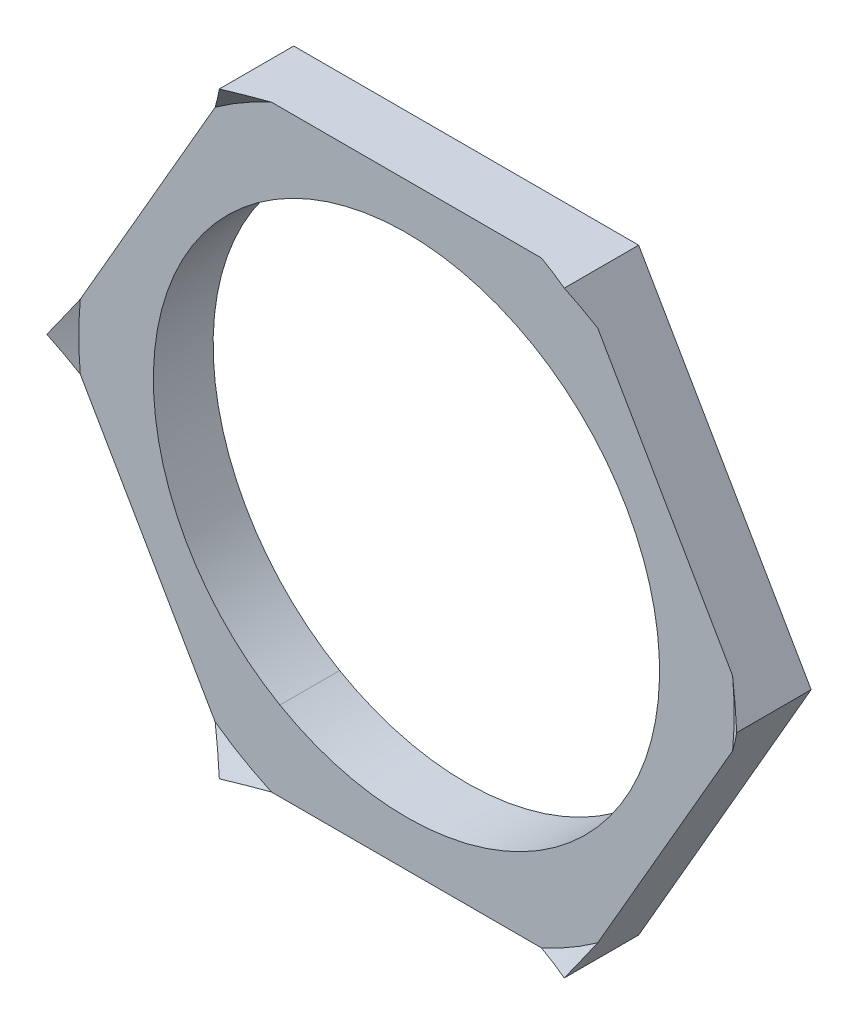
ISO-10303-21;
HEADER;
FILE_DESCRIPTION(('STEP AP214'),'2;1');
FILE_NAME('part.step','',(''),(''),'','','');
FILE_SCHEMA(('AUTOMOTIVE_DESIGN { 1 0 10303 214 1 1 1 1 }'));
ENDSEC;
DATA;
#1=APPLICATION_CONTEXT('core data for automotive mechanical design processes');
#2=APPLICATION_PROTOCOL_DEFINITION('international standard','automotive_design',2000,#1);
#3=PRODUCT_CONTEXT('',#1,'mechanical');
#4=PRODUCT('Part','Part','',(#3));
#5=PRODUCT_RELATED_PRODUCT_CATEGORY('part','',(#4));
#6=PRODUCT_DEFINITION_FORMATION('','',#4);
#7=PRODUCT_DEFINITION_CONTEXT('part definition',#1,'design');
#8=PRODUCT_DEFINITION('design','',#6,#7);
#9=PRODUCT_DEFINITION_SHAPE('','',#8);
#10=(LENGTH_UNIT() NAMED_UNIT(*) SI_UNIT(.MILLI.,.METRE.));
#11=(NAMED_UNIT(*) PLANE_ANGLE_UNIT() SI_UNIT($,.RADIAN.));
#12=(NAMED_UNIT(*) SI_UNIT($,.STERADIAN.) SOLID_ANGLE_UNIT());
#13=UNCERTAINTY_MEASURE_WITH_UNIT(LENGTH_MEASURE(1.E-05),#10,'distance_accuracy_value','');
#14=(GEOMETRIC_REPRESENTATION_CONTEXT(3) GLOBAL_UNCERTAINTY_ASSIGNED_CONTEXT((#13)) GLOBAL_UNIT_ASSIGNED_CONTEXT((#10,
#11,#12)) REPRESENTATION_CONTEXT('',''));
#15=CARTESIAN_POINT('',(0.,0.,0.));
#16=DIRECTION('',(0.,0.,1.));
#17=DIRECTION('',(1.,0.,0.));
#18=AXIS2_PLACEMENT_3D('',#15,#16,#17);
#19=CARTESIAN_POINT('',(0.,0.,-10.4));
#20=DIRECTION('',(0.,0.,1.));
#21=DIRECTION('',(-0.866025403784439,0.5,0.));
#22=AXIS2_PLACEMENT_3D('',#19,#20,#21);
#23=PLANE('',#22);
#24=CARTESIAN_POINT('',(0.,0.,-10.4));
#25=DIRECTION('',(0.,0.,1.));
#26=DIRECTION('',(0.5,0.866025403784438,0.));
#27=AXIS2_PLACEMENT_3D('',#24,#25,#26);
#28=CIRCLE('',#27,15.25);
#29=CARTESIAN_POINT('',(-7.625,-13.2068874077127,-10.4));
#30=VERTEX_POINT('',#29);
#31=CARTESIAN_POINT('',(7.625,13.2068874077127,-10.4));
#32=VERTEX_POINT('',#31);
#33=EDGE_CURVE('E507',#30,#32,#28,.T.);
#34=ORIENTED_EDGE('',*,*,#33,.F.);
#35=CARTESIAN_POINT('',(0.,0.,-10.4));
#36=DIRECTION('',(0.,0.,1.));
#37=DIRECTION('',(0.5,0.866025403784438,0.));
#38=AXIS2_PLACEMENT_3D('',#35,#36,#37);
#39=CIRCLE('',#38,15.25);
#40=EDGE_CURVE('E536',#32,#30,#39,.T.);
#41=ORIENTED_EDGE('',*,*,#40,.F.);
#42=EDGE_LOOP('',(#34,#41));
#43=FACE_BOUND('',#42,.T.);
#44=DIRECTION('',(-1.,0.,0.));
#45=VECTOR('',#44,1.);
#46=CARTESIAN_POINT('',(-10.3923048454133,18.,-10.4));
#47=LINE('',#46,#45);
#48=CARTESIAN_POINT('',(8.12788410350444,18.,-10.4));
#49=VERTEX_POINT('',#48);
#50=CARTESIAN_POINT('',(-8.12788410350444,18.,-10.4));
#51=VERTEX_POINT('',#50);
#52=EDGE_CURVE('E478',#49,#51,#47,.T.);
#53=ORIENTED_EDGE('',*,*,#52,.T.);
#54=CARTESIAN_POINT('',(0.,0.,-10.4));
#55=DIRECTION('',(0.,0.,1.));
#56=DIRECTION('',(0.5,0.866025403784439,0.));
#57=AXIS2_PLACEMENT_3D('',#54,#55,#56);
#58=CIRCLE('',#57,19.75);
#59=CARTESIAN_POINT('',(-11.5245152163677,16.0389541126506,-10.4));
#60=VERTEX_POINT('',#59);
#61=EDGE_CURVE('E377',#51,#60,#58,.T.);
#62=ORIENTED_EDGE('',*,*,#61,.T.);
#63=DIRECTION('',(-0.5,-0.866025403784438,0.));
#64=VECTOR('',#63,1.);
#65=CARTESIAN_POINT('',(-10.3923048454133,18.,-10.4));
#66=LINE('',#65,#64);
#67=CARTESIAN_POINT('',(-19.6523993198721,1.96104588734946,-10.4));
#68=VERTEX_POINT('',#67);
#69=EDGE_CURVE('E416',#60,#68,#66,.T.);
#70=ORIENTED_EDGE('',*,*,#69,.T.);
#71=CARTESIAN_POINT('',(0.,0.,-10.4));
#72=DIRECTION('',(0.,0.,1.));
#73=DIRECTION('',(0.5,0.866025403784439,0.));
#74=AXIS2_PLACEMENT_3D('',#71,#72,#73);
#75=CIRCLE('',#74,19.75);
#76=CARTESIAN_POINT('',(-19.6523993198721,-1.96104588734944,-10.4));
#77=VERTEX_POINT('',#76);
#78=EDGE_CURVE('E374',#68,#77,#75,.T.);
#79=ORIENTED_EDGE('',*,*,#78,.T.);
#80=DIRECTION('',(0.5,-0.866025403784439,0.));
#81=VECTOR('',#80,1.);
#82=CARTESIAN_POINT('',(-20.7846096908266,0.,-10.4));
#83=LINE('',#82,#81);
#84=CARTESIAN_POINT('',(-11.5245152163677,-16.0389541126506,-10.4));
#85=VERTEX_POINT('',#84);
#86=EDGE_CURVE('E344',#77,#85,#83,.T.);
#87=ORIENTED_EDGE('',*,*,#86,.T.);
#88=CARTESIAN_POINT('',(0.,0.,-10.4));
#89=DIRECTION('',(0.,0.,1.));
#90=DIRECTION('',(0.5,0.866025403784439,0.));
#91=AXIS2_PLACEMENT_3D('',#88,#89,#90);
#92=CIRCLE('',#91,19.75);
#93=CARTESIAN_POINT('',(-8.12788410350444,-18.,-10.4));
#94=VERTEX_POINT('',#93);
#95=EDGE_CURVE('E25',#85,#94,#92,.T.);
#96=ORIENTED_EDGE('',*,*,#95,.T.);
#97=DIRECTION('',(1.,0.,0.));
#98=VECTOR('',#97,1.);
#99=CARTESIAN_POINT('',(10.3923048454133,-18.,-10.4));
#100=LINE('',#99,#98);
#101=CARTESIAN_POINT('',(8.12788410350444,-18.,-10.4));
#102=VERTEX_POINT('',#101);
#103=EDGE_CURVE('E539',#94,#102,#100,.T.);
#104=ORIENTED_EDGE('',*,*,#103,.T.);
#105=CARTESIAN_POINT('',(0.,0.,-10.4));
#106=DIRECTION('',(0.,0.,1.));
#107=DIRECTION('',(0.5,0.866025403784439,0.));
#108=AXIS2_PLACEMENT_3D('',#105,#106,#107);
#109=CIRCLE('',#108,19.75);
#110=CARTESIAN_POINT('',(11.5245152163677,-16.0389541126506,-10.4));
#111=VERTEX_POINT('',#110);
#112=EDGE_CURVE('E11',#102,#111,#109,.T.);
#113=ORIENTED_EDGE('',*,*,#112,.T.);
#114=DIRECTION('',(0.5,0.866025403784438,0.));
#115=VECTOR('',#114,1.);
#116=CARTESIAN_POINT('',(20.7846096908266,0.,-10.4));
#117=LINE('',#116,#115);
#118=CARTESIAN_POINT('',(19.6523993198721,-1.96104588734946,-10.4));
#119=VERTEX_POINT('',#118);
#120=EDGE_CURVE('E582',#111,#119,#117,.T.);
#121=ORIENTED_EDGE('',*,*,#120,.T.);
#122=CARTESIAN_POINT('',(0.,0.,-10.4));
#123=DIRECTION('',(0.,0.,1.));
#124=DIRECTION('',(0.5,0.866025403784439,0.));
#125=AXIS2_PLACEMENT_3D('',#122,#123,#124);
#126=CIRCLE('',#125,19.75);
#127=CARTESIAN_POINT('',(19.6523993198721,1.96104588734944,-10.4));
#128=VERTEX_POINT('',#127);
#129=EDGE_CURVE('E252',#119,#128,#126,.T.);
#130=ORIENTED_EDGE('',*,*,#129,.T.);
#131=DIRECTION('',(-0.5,0.866025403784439,0.));
#132=VECTOR('',#131,1.);
#133=CARTESIAN_POINT('',(20.7846096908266,0.,-10.4));
#134=LINE('',#133,#132);
#135=CARTESIAN_POINT('',(11.5245152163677,16.0389541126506,-10.4));
#136=VERTEX_POINT('',#135);
#137=EDGE_CURVE('E591',#128,#136,#134,.T.);
#138=ORIENTED_EDGE('',*,*,#137,.T.);
#139=CARTESIAN_POINT('',(0.,0.,-10.4));
#140=DIRECTION('',(0.,0.,1.));
#141=DIRECTION('',(0.5,0.866025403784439,0.));
#142=AXIS2_PLACEMENT_3D('',#139,#140,#141);
#143=CIRCLE('',#142,19.75);
#144=CARTESIAN_POINT('',(9.875,17.1040017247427,-10.4));
#145=VERTEX_POINT('',#144);
#146=EDGE_CURVE('E297',#136,#145,#143,.T.);
#147=ORIENTED_EDGE('',*,*,#146,.T.);
#148=CARTESIAN_POINT('',(0.,0.,-10.4));
#149=DIRECTION('',(0.,0.,1.));
#150=DIRECTION('',(0.5,0.866025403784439,0.));
#151=AXIS2_PLACEMENT_3D('',#148,#149,#150);
#152=CIRCLE('',#151,19.75);
#153=EDGE_CURVE('E204',#145,#49,#152,.T.);
#154=ORIENTED_EDGE('',*,*,#153,.T.);
#155=EDGE_LOOP('',(#53,#62,#70,#79,#87,#96,#104,#113,#121,#130,#138,#147,#154));
#156=FACE_BOUND('',#155,.T.);
#157=ADVANCED_FACE('F16',(#43,#156),#23,.T.);
#158=CARTESIAN_POINT('',(0.,0.,-10.4));
#159=DIRECTION('',(0.,0.,1.));
#160=DIRECTION('',(0.5,0.866025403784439,0.));
#161=AXIS2_PLACEMENT_3D('',#158,#159,#160);
#162=CONICAL_SURFACE('',#161,19.75,0.863937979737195);
#163=CARTESIAN_POINT('',(10.3923048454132,-18.,-9.51635984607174));
#164=CARTESIAN_POINT('',(10.4400320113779,-17.9173340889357,-9.55712261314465));
#165=CARTESIAN_POINT('',(10.4878348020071,-17.834536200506,-9.5975297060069));
#166=CARTESIAN_POINT('',(10.5832433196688,-17.6692808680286,-9.67731426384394));
#167=CARTESIAN_POINT('',(10.6308479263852,-17.5868253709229,-9.71669710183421));
#168=CARTESIAN_POINT('',(10.7258693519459,-17.4222398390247,-9.79443330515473));
#169=CARTESIAN_POINT('',(10.7732850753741,-17.340111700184,-9.83279202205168));
#170=CARTESIAN_POINT('',(10.8679381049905,-17.1761653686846,-9.90847996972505));
#171=CARTESIAN_POINT('',(10.9151743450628,-17.0943490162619,-9.94581451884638));
#172=CARTESIAN_POINT('',(11.0094779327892,-16.9310101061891,-10.0194541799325));
#173=CARTESIAN_POINT('',(11.0565442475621,-16.8494893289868,-10.0557645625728));
#174=CARTESIAN_POINT('',(11.1505175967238,-16.6867247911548,-10.1273559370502));
#175=CARTESIAN_POINT('',(11.1974236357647,-16.6054827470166,-10.1626421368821));
#176=CARTESIAN_POINT('',(11.2910861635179,-16.4432582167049,-10.2321852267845));
#177=CARTESIAN_POINT('',(11.3378416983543,-16.3622773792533,-10.2664472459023));
#178=CARTESIAN_POINT('',(11.431212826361,-16.2005572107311,-10.3339420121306));
#179=CARTESIAN_POINT('',(11.4778275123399,-16.1198194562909,-10.3671797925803));
#180=CARTESIAN_POINT('',(11.5245152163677,-16.0389541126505,-10.4));
#181=B_SPLINE_CURVE_WITH_KNOTS('',3,(#163,#164,#165,#166,#167,#168,#169,#170,#171,#172,#173,
#174,#175,#176,#177,#178,#179,#180),.UNSPECIFIED.,.F.,.F.,(4,2,2,2,2,2,2,2,4),(0.,
0.311380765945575,0.62048133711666,0.927369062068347,1.23211385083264,1.53478821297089,
1.8354672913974,2.13422889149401,2.43115350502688),.UNSPECIFIED.);
#182=CARTESIAN_POINT('',(10.3923048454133,-18.,-9.51635984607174));
#183=VERTEX_POINT('',#182);
#184=EDGE_CURVE('E575',#183,#111,#181,.T.);
#185=ORIENTED_EDGE('',*,*,#184,.T.);
#186=ORIENTED_EDGE('',*,*,#112,.F.);
#187=CARTESIAN_POINT('',(8.12788410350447,-18.,-10.4));
#188=CARTESIAN_POINT('',(8.22125939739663,-17.9999999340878,-10.3671797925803));
#189=CARTESIAN_POINT('',(8.31448768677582,-17.9999993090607,-10.3339420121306));
#190=CARTESIAN_POINT('',(8.50122702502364,-17.9999976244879,-10.2664472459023));
#191=CARTESIAN_POINT('',(8.5947362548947,-17.9999965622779,-10.2321852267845));
#192=CARTESIAN_POINT('',(8.78205808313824,-17.9999946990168,-10.1626421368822));
#193=CARTESIAN_POINT('',(8.87586877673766,-17.9999938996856,-10.1273559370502));
#194=CARTESIAN_POINT('',(9.06381367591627,-17.9999928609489,-10.0557645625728));
#195=CARTESIAN_POINT('',(9.15794589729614,-17.9999926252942,-10.0194541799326));
#196=CARTESIAN_POINT('',(9.34655333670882,-17.9999927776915,-9.94581451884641));
#197=CARTESIAN_POINT('',(9.44102649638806,-17.999993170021,-9.90847996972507));
#198=CARTESIAN_POINT('',(9.630334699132,-17.9999944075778,-9.8327920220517));
#199=CARTESIAN_POINT('',(9.72516761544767,-17.9999952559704,-9.79443330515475));
#200=CARTESIAN_POINT('',(9.91521357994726,-17.9999970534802,-9.71669710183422));
#201=CARTESIAN_POINT('',(10.0104244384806,-17.9999980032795,-9.67731426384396));
#202=CARTESIAN_POINT('',(10.2012440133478,-17.9999994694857,-9.59752970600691));
#203=CARTESIAN_POINT('',(10.2968504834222,-17.9999999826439,-9.55712261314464));
#204=CARTESIAN_POINT('',(10.3923048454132,-18.,-9.51635984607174));
#205=B_SPLINE_CURVE_WITH_KNOTS('',3,(#187,#188,#189,#190,#191,#192,#193,#194,#195,#196,#197,
#198,#199,#200,#201,#202,#203,#204),.UNSPECIFIED.,.F.,.F.,(4,2,2,2,2,2,2,2,4),(0.,
0.296924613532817,0.59568621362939,0.896365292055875,1.1990396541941,1.50378444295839,
1.8106721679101,2.11977273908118,2.43115350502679),.UNSPECIFIED.);
#206=EDGE_CURVE('E548',#102,#183,#205,.T.);
#207=ORIENTED_EDGE('',*,*,#206,.T.);
#208=EDGE_LOOP('',(#185,#186,#207));
#209=FACE_BOUND('',#208,.T.);
#210=ADVANCED_FACE('F557',(#209),#162,.F.);
#211=CARTESIAN_POINT('',(0.,0.,-10.4));
#212=DIRECTION('',(0.,0.,1.));
#213=DIRECTION('',(0.5,0.866025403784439,0.));
#214=AXIS2_PLACEMENT_3D('',#211,#212,#213);
#215=CONICAL_SURFACE('',#214,19.75,0.863937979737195);
#216=CARTESIAN_POINT('',(-11.5245152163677,-16.0389541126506,-10.4));
#217=CARTESIAN_POINT('',(-11.4778275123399,-16.1198194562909,-10.3671797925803));
#218=CARTESIAN_POINT('',(-11.431212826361,-16.2005572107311,-10.3339420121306));
#219=CARTESIAN_POINT('',(-11.3378416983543,-16.3622773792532,-10.2664472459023));
#220=CARTESIAN_POINT('',(-11.2910861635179,-16.4432582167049,-10.2321852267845));
#221=CARTESIAN_POINT('',(-11.1974236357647,-16.6054827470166,-10.1626421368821));
#222=CARTESIAN_POINT('',(-11.1505175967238,-16.6867247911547,-10.1273559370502));
#223=CARTESIAN_POINT('',(-11.0565442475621,-16.8494893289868,-10.0557645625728));
#224=CARTESIAN_POINT('',(-11.0094779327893,-16.9310101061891,-10.0194541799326));
#225=CARTESIAN_POINT('',(-10.9151743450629,-17.0943490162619,-9.94581451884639));
#226=CARTESIAN_POINT('',(-10.8679381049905,-17.1761653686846,-9.90847996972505));
#227=CARTESIAN_POINT('',(-10.7732850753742,-17.340111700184,-9.83279202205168));
#228=CARTESIAN_POINT('',(-10.7258693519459,-17.4222398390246,-9.79443330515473));
#229=CARTESIAN_POINT('',(-10.6308479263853,-17.5868253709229,-9.71669710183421));
#230=CARTESIAN_POINT('',(-10.5832433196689,-17.6692808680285,-9.67731426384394));
#231=CARTESIAN_POINT('',(-10.4878348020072,-17.834536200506,-9.59752970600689));
#232=CARTESIAN_POINT('',(-10.440032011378,-17.9173340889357,-9.55712261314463));
#233=CARTESIAN_POINT('',(-10.3923048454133,-18.,-9.51635984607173));
#234=B_SPLINE_CURVE_WITH_KNOTS('',3,(#216,#217,#218,#219,#220,#221,#222,#223,#224,#225,#226,
#227,#228,#229,#230,#231,#232,#233),.UNSPECIFIED.,.F.,.F.,(4,2,2,2,2,2,2,2,4),(0.,
0.296924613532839,0.595686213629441,0.89636529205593,1.19903965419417,1.50378444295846,
1.81067216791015,2.11977273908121,2.4311535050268),.UNSPECIFIED.);
#235=CARTESIAN_POINT('',(-10.3923048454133,-18.,-9.51635984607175));
#236=VERTEX_POINT('',#235);
#237=EDGE_CURVE('E328',#85,#236,#234,.T.);
#238=ORIENTED_EDGE('',*,*,#237,.T.);
#239=CARTESIAN_POINT('',(-10.3923048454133,-18.,-9.51635984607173));
#240=CARTESIAN_POINT('',(-10.2968504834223,-17.9999999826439,-9.55712261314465));
#241=CARTESIAN_POINT('',(-10.2012440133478,-17.9999994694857,-9.59752970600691));
#242=CARTESIAN_POINT('',(-10.0104244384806,-17.9999980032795,-9.67731426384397));
#243=CARTESIAN_POINT('',(-9.91521357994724,-17.9999970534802,-9.71669710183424));
#244=CARTESIAN_POINT('',(-9.72516761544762,-17.9999952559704,-9.79443330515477));
#245=CARTESIAN_POINT('',(-9.63033469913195,-17.9999944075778,-9.83279202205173));
#246=CARTESIAN_POINT('',(-9.44102649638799,-17.999993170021,-9.9084799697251));
#247=CARTESIAN_POINT('',(-9.34655333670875,-17.9999927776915,-9.94581451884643));
#248=CARTESIAN_POINT('',(-9.15794589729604,-17.9999926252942,-10.0194541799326));
#249=CARTESIAN_POINT('',(-9.06381367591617,-17.9999928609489,-10.0557645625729));
#250=CARTESIAN_POINT('',(-8.87586877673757,-17.9999938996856,-10.1273559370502));
#251=CARTESIAN_POINT('',(-8.78205808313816,-17.9999946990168,-10.1626421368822));
#252=CARTESIAN_POINT('',(-8.59473625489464,-17.9999965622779,-10.2321852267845));
#253=CARTESIAN_POINT('',(-8.50122702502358,-17.9999976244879,-10.2664472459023));
#254=CARTESIAN_POINT('',(-8.31448768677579,-17.9999993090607,-10.3339420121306));
#255=CARTESIAN_POINT('',(-8.22125939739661,-17.9999999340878,-10.3671797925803));
#256=CARTESIAN_POINT('',(-8.12788410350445,-18.,-10.4));
#257=B_SPLINE_CURVE_WITH_KNOTS('',3,(#239,#240,#241,#242,#243,#244,#245,#246,#247,#248,#249,
#250,#251,#252,#253,#254,#255,#256),.UNSPECIFIED.,.F.,.F.,(4,2,2,2,2,2,2,2,4),(0.,
0.311380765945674,0.620481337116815,0.927369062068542,1.23211385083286,1.53478821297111,
1.83546729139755,2.13422889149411,2.43115350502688),.UNSPECIFIED.);
#258=EDGE_CURVE('E549',#236,#94,#257,.T.);
#259=ORIENTED_EDGE('',*,*,#258,.T.);
#260=ORIENTED_EDGE('',*,*,#95,.F.);
#261=EDGE_LOOP('',(#238,#259,#260));
#262=FACE_BOUND('',#261,.T.);
#263=ADVANCED_FACE('F227',(#262),#215,.F.);
#264=CARTESIAN_POINT('',(0.,0.,-10.4));
#265=DIRECTION('',(0.,0.,1.));
#266=DIRECTION('',(0.5,0.866025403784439,0.));
#267=AXIS2_PLACEMENT_3D('',#264,#265,#266);
#268=CONICAL_SURFACE('',#267,19.75,0.863937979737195);
#269=CARTESIAN_POINT('',(20.7846096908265,0.,-9.51635984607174));
#270=CARTESIAN_POINT('',(20.7368824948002,0.0826658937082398,-9.55712261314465));
#271=CARTESIAN_POINT('',(20.689078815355,0.165463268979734,-9.59752970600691));
#272=CARTESIAN_POINT('',(20.5936677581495,0.330717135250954,-9.67731426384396));
#273=CARTESIAN_POINT('',(20.5460615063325,0.413171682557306,-9.71669710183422));
#274=CARTESIAN_POINT('',(20.4510369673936,0.577755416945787,-9.79443330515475));
#275=CARTESIAN_POINT('',(20.4036197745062,0.659882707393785,-9.83279202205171));
#276=CARTESIAN_POINT('',(20.3089646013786,0.823827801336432,-9.90847996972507));
#277=CARTESIAN_POINT('',(20.2617276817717,0.905643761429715,-9.94581451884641));
#278=CARTESIAN_POINT('',(20.1674238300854,1.06898251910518,-10.0194541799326));
#279=CARTESIAN_POINT('',(20.1203579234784,1.15050353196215,-10.0557645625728));
#280=CARTESIAN_POINT('',(20.0263863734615,1.31326910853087,-10.1273559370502));
#281=CARTESIAN_POINT('',(19.9794817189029,1.39451195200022,-10.1626421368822));
#282=CARTESIAN_POINT('',(19.8858224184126,1.55673834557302,-10.2321852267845));
#283=CARTESIAN_POINT('',(19.8390687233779,1.6377202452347,-10.2664472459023));
#284=CARTESIAN_POINT('',(19.7457005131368,1.79944209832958,-10.3339420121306));
#285=CARTESIAN_POINT('',(19.6990869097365,1.88018047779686,-10.3671797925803));
#286=CARTESIAN_POINT('',(19.6523993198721,1.96104588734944,-10.4));
#287=B_SPLINE_CURVE_WITH_KNOTS('',3,(#269,#270,#271,#272,#273,#274,#275,#276,#277,#278,#279,
#280,#281,#282,#283,#284,#285,#286),.UNSPECIFIED.,.F.,.F.,(4,2,2,2,2,2,2,2,4),(0.,
0.311380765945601,0.620481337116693,0.927369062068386,1.2321138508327,1.53478821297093,
1.8354672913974,2.13422889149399,2.43115350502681),.UNSPECIFIED.);
#288=CARTESIAN_POINT('',(20.7846096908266,0.,-9.51635984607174));
#289=VERTEX_POINT('',#288);
#290=EDGE_CURVE('E210',#289,#128,#287,.T.);
#291=ORIENTED_EDGE('',*,*,#290,.T.);
#292=ORIENTED_EDGE('',*,*,#129,.F.);
#293=CARTESIAN_POINT('',(19.6523993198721,-1.96104588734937,-10.4));
#294=CARTESIAN_POINT('',(19.6990869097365,-1.88018047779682,-10.3671797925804));
#295=CARTESIAN_POINT('',(19.7457005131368,-1.79944209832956,-10.3339420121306));
#296=CARTESIAN_POINT('',(19.8390687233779,-1.63772024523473,-10.2664472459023));
#297=CARTESIAN_POINT('',(19.8858224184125,-1.55673834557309,-10.2321852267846));
#298=CARTESIAN_POINT('',(19.9794817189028,-1.39451195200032,-10.1626421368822));
#299=CARTESIAN_POINT('',(20.0263863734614,-1.31326910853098,-10.1273559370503));
#300=CARTESIAN_POINT('',(20.1203579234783,-1.15050353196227,-10.0557645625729));
#301=CARTESIAN_POINT('',(20.1674238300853,-1.06898251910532,-10.0194541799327));
#302=CARTESIAN_POINT('',(20.2617276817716,-0.905643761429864,-9.94581451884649));
#303=CARTESIAN_POINT('',(20.3089646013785,-0.823827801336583,-9.90847996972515));
#304=CARTESIAN_POINT('',(20.4036197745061,-0.659882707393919,-9.83279202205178));
#305=CARTESIAN_POINT('',(20.4510369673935,-0.577755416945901,-9.79443330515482));
#306=CARTESIAN_POINT('',(20.5460615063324,-0.413171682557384,-9.71669710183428));
#307=CARTESIAN_POINT('',(20.5936677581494,-0.330717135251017,-9.677314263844));
#308=CARTESIAN_POINT('',(20.6890788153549,-0.165463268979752,-9.59752970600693));
#309=CARTESIAN_POINT('',(20.7368824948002,-0.0826658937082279,-9.55712261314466));
#310=CARTESIAN_POINT('',(20.7846096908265,0.,-9.51635984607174));
#311=B_SPLINE_CURVE_WITH_KNOTS('',3,(#293,#294,#295,#296,#297,#298,#299,#300,#301,#302,#303,
#304,#305,#306,#307,#308,#309,#310),.UNSPECIFIED.,.F.,.F.,(4,2,2,2,2,2,2,2,4),(0.,
0.296924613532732,0.595686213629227,0.896365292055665,1.19903965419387,1.50378444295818,
1.81067216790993,2.11977273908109,2.4311535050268),.UNSPECIFIED.);
#312=EDGE_CURVE('E247',#119,#289,#311,.T.);
#313=ORIENTED_EDGE('',*,*,#312,.T.);
#314=EDGE_LOOP('',(#291,#292,#313));
#315=FACE_BOUND('',#314,.T.);
#316=ADVANCED_FACE('F216',(#315),#268,.F.);
#317=CARTESIAN_POINT('',(0.,0.,-10.4));
#318=DIRECTION('',(0.,0.,1.));
#319=DIRECTION('',(0.5,0.866025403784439,0.));
#320=AXIS2_PLACEMENT_3D('',#317,#318,#319);
#321=CONICAL_SURFACE('',#320,19.75,0.863937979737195);
#322=DIRECTION('',(0.380202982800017,0.658530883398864,0.649448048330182));
#323=VECTOR('',#322,1.);
#324=CARTESIAN_POINT('',(9.875,17.1040017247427,-10.4));
#325=LINE('',#324,#323);
#326=CARTESIAN_POINT('',(10.3923048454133,18.,-9.51635984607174));
#327=VERTEX_POINT('',#326);
#328=EDGE_CURVE('E201',#145,#327,#325,.T.);
#329=ORIENTED_EDGE('',*,*,#328,.F.);
#330=ORIENTED_EDGE('',*,*,#146,.F.);
#331=CARTESIAN_POINT('',(11.5245152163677,16.0389541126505,-10.4));
#332=CARTESIAN_POINT('',(11.47782751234,16.1198194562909,-10.3671797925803));
#333=CARTESIAN_POINT('',(11.431212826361,16.2005572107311,-10.3339420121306));
#334=CARTESIAN_POINT('',(11.3378416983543,16.3622773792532,-10.2664472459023));
#335=CARTESIAN_POINT('',(11.2910861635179,16.4432582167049,-10.2321852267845));
#336=CARTESIAN_POINT('',(11.1974236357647,16.6054827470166,-10.1626421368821));
#337=CARTESIAN_POINT('',(11.1505175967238,16.6867247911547,-10.1273559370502));
#338=CARTESIAN_POINT('',(11.0565442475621,16.8494893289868,-10.0557645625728));
#339=CARTESIAN_POINT('',(11.0094779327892,16.9310101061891,-10.0194541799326));
#340=CARTESIAN_POINT('',(10.9151743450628,17.0943490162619,-9.9458145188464));
#341=CARTESIAN_POINT('',(10.8679381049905,17.1761653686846,-9.90847996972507));
#342=CARTESIAN_POINT('',(10.7732850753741,17.340111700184,-9.8327920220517));
#343=CARTESIAN_POINT('',(10.7258693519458,17.4222398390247,-9.79443330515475));
#344=CARTESIAN_POINT('',(10.6308479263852,17.5868253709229,-9.71669710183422));
#345=CARTESIAN_POINT('',(10.5832433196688,17.6692808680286,-9.67731426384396));
#346=CARTESIAN_POINT('',(10.4878348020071,17.8345362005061,-9.59752970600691));
#347=CARTESIAN_POINT('',(10.4400320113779,17.9173340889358,-9.55712261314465));
#348=CARTESIAN_POINT('',(10.3923048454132,18.,-9.51635984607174));
#349=B_SPLINE_CURVE_WITH_KNOTS('',3,(#331,#332,#333,#334,#335,#336,#337,#338,#339,#340,#341,
#342,#343,#344,#345,#346,#347,#348),.UNSPECIFIED.,.F.,.F.,(4,2,2,2,2,2,2,2,4),(0.,
0.296924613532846,0.595686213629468,0.896365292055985,1.19903965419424,1.50378444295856,
1.81067216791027,2.11977273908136,2.43115350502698),.UNSPECIFIED.);
#350=EDGE_CURVE('E167',#136,#327,#349,.T.);
#351=ORIENTED_EDGE('',*,*,#350,.T.);
#352=EDGE_LOOP('',(#329,#330,#351));
#353=FACE_BOUND('',#352,.T.);
#354=ADVANCED_FACE('F226',(#353),#321,.F.);
#355=CARTESIAN_POINT('',(0.,0.,-10.4));
#356=DIRECTION('',(0.,0.,1.));
#357=DIRECTION('',(0.5,0.866025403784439,0.));
#358=AXIS2_PLACEMENT_3D('',#355,#356,#357);
#359=CONICAL_SURFACE('',#358,19.75,0.863937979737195);
#360=CARTESIAN_POINT('',(-19.6523993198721,1.9610458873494,-10.4));
#361=CARTESIAN_POINT('',(-19.6990869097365,1.88018047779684,-10.3671797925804));
#362=CARTESIAN_POINT('',(-19.7457005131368,1.79944209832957,-10.3339420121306));
#363=CARTESIAN_POINT('',(-19.8390687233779,1.63772024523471,-10.2664472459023));
#364=CARTESIAN_POINT('',(-19.8858224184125,1.55673834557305,-10.2321852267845));
#365=CARTESIAN_POINT('',(-19.9794817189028,1.39451195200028,-10.1626421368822));
#366=CARTESIAN_POINT('',(-20.0263863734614,1.31326910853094,-10.1273559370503));
#367=CARTESIAN_POINT('',(-20.1203579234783,1.15050353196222,-10.0557645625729));
#368=CARTESIAN_POINT('',(-20.1674238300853,1.06898251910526,-10.0194541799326));
#369=CARTESIAN_POINT('',(-20.2617276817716,0.905643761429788,-9.94581451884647));
#370=CARTESIAN_POINT('',(-20.3089646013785,0.823827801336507,-9.90847996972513));
#371=CARTESIAN_POINT('',(-20.4036197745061,0.659882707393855,-9.83279202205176));
#372=CARTESIAN_POINT('',(-20.4510369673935,0.57775541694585,-9.7944333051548));
#373=CARTESIAN_POINT('',(-20.5460615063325,0.413171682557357,-9.71669710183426));
#374=CARTESIAN_POINT('',(-20.5936677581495,0.330717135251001,-9.67731426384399));
#375=CARTESIAN_POINT('',(-20.689078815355,0.165463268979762,-9.59752970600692));
#376=CARTESIAN_POINT('',(-20.7368824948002,0.0826658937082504,-9.55712261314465));
#377=CARTESIAN_POINT('',(-20.7846096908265,0.,-9.51635984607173));
#378=B_SPLINE_CURVE_WITH_KNOTS('',3,(#360,#361,#362,#363,#364,#365,#366,#367,#368,#369,#370,
#371,#372,#373,#374,#375,#376,#377),.UNSPECIFIED.,.F.,.F.,(4,2,2,2,2,2,2,2,4),(0.,
0.296924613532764,0.5956862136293,0.896365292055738,1.19903965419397,1.50378444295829,
1.81067216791,2.11977273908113,2.4311535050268),.UNSPECIFIED.);
#379=CARTESIAN_POINT('',(-20.7846096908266,0.,-9.51635984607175));
#380=VERTEX_POINT('',#379);
#381=EDGE_CURVE('E371',#68,#380,#378,.T.);
#382=ORIENTED_EDGE('',*,*,#381,.T.);
#383=CARTESIAN_POINT('',(-20.7846096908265,0.,-9.51635984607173));
#384=CARTESIAN_POINT('',(-20.7368824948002,-0.0826658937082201,-9.55712261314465));
#385=CARTESIAN_POINT('',(-20.689078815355,-0.165463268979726,-9.59752970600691));
#386=CARTESIAN_POINT('',(-20.5936677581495,-0.330717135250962,-9.67731426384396));
#387=CARTESIAN_POINT('',(-20.5460615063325,-0.41317168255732,-9.71669710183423));
#388=CARTESIAN_POINT('',(-20.4510369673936,-0.577755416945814,-9.79443330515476));
#389=CARTESIAN_POINT('',(-20.4036197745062,-0.659882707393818,-9.83279202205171));
#390=CARTESIAN_POINT('',(-20.3089646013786,-0.82382780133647,-9.90847996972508));
#391=CARTESIAN_POINT('',(-20.2617276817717,-0.905643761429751,-9.94581451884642));
#392=CARTESIAN_POINT('',(-20.1674238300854,-1.06898251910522,-10.0194541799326));
#393=CARTESIAN_POINT('',(-20.1203579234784,-1.15050353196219,-10.0557645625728));
#394=CARTESIAN_POINT('',(-20.0263863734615,-1.31326910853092,-10.1273559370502));
#395=CARTESIAN_POINT('',(-19.9794817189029,-1.39451195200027,-10.1626421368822));
#396=CARTESIAN_POINT('',(-19.8858224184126,-1.55673834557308,-10.2321852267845));
#397=CARTESIAN_POINT('',(-19.8390687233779,-1.63772024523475,-10.2664472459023));
#398=CARTESIAN_POINT('',(-19.7457005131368,-1.79944209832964,-10.3339420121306));
#399=CARTESIAN_POINT('',(-19.6990869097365,-1.88018047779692,-10.3671797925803));
#400=CARTESIAN_POINT('',(-19.6523993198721,-1.96104588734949,-10.4));
#401=B_SPLINE_CURVE_WITH_KNOTS('',3,(#383,#384,#385,#386,#387,#388,#389,#390,#391,#392,#393,
#394,#395,#396,#397,#398,#399,#400),.UNSPECIFIED.,.F.,.F.,(4,2,2,2,2,2,2,2,4),(0.,
0.311380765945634,0.620481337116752,0.927369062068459,1.23211385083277,1.53478821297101,
1.83546729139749,2.13422889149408,2.43115350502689),.UNSPECIFIED.);
#402=EDGE_CURVE('E411',#380,#77,#401,.T.);
#403=ORIENTED_EDGE('',*,*,#402,.T.);
#404=ORIENTED_EDGE('',*,*,#78,.F.);
#405=EDGE_LOOP('',(#382,#403,#404));
#406=FACE_BOUND('',#405,.T.);
#407=ADVANCED_FACE('F391',(#406),#359,.F.);
#408=CARTESIAN_POINT('',(0.,0.,-10.4));
#409=DIRECTION('',(0.,0.,1.));
#410=DIRECTION('',(0.5,0.866025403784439,0.));
#411=AXIS2_PLACEMENT_3D('',#408,#409,#410);
#412=CONICAL_SURFACE('',#411,19.75,0.863937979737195);
#413=CARTESIAN_POINT('',(-8.12788410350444,18.,-10.4));
#414=CARTESIAN_POINT('',(-8.22125939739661,17.9999999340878,-10.3671797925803));
#415=CARTESIAN_POINT('',(-8.3144876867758,17.9999993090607,-10.3339420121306));
#416=CARTESIAN_POINT('',(-8.50122702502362,17.9999976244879,-10.2664472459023));
#417=CARTESIAN_POINT('',(-8.59473625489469,17.9999965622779,-10.2321852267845));
#418=CARTESIAN_POINT('',(-8.78205808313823,17.9999946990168,-10.1626421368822));
#419=CARTESIAN_POINT('',(-8.87586877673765,17.9999938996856,-10.1273559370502));
#420=CARTESIAN_POINT('',(-9.06381367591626,17.9999928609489,-10.0557645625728));
#421=CARTESIAN_POINT('',(-9.15794589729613,17.9999926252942,-10.0194541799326));
#422=CARTESIAN_POINT('',(-9.34655333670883,17.9999927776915,-9.94581451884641));
#423=CARTESIAN_POINT('',(-9.44102649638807,17.999993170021,-9.90847996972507));
#424=CARTESIAN_POINT('',(-9.63033469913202,17.9999944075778,-9.83279202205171));
#425=CARTESIAN_POINT('',(-9.72516761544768,17.9999952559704,-9.79443330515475));
#426=CARTESIAN_POINT('',(-9.91521357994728,17.9999970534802,-9.71669710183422));
#427=CARTESIAN_POINT('',(-10.0104244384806,17.9999980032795,-9.67731426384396));
#428=CARTESIAN_POINT('',(-10.2012440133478,17.9999994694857,-9.59752970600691));
#429=CARTESIAN_POINT('',(-10.2968504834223,17.9999999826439,-9.55712261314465));
#430=CARTESIAN_POINT('',(-10.3923048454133,18.,-9.51635984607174));
#431=B_SPLINE_CURVE_WITH_KNOTS('',3,(#413,#414,#415,#416,#417,#418,#419,#420,#421,#422,#423,
#424,#425,#426,#427,#428,#429,#430),.UNSPECIFIED.,.F.,.F.,(4,2,2,2,2,2,2,2,4),(0.,
0.296924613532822,0.595686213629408,0.896365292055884,1.19903965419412,1.50378444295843,
1.81067216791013,2.11977273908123,2.43115350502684),.UNSPECIFIED.);
#432=CARTESIAN_POINT('',(-10.3923048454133,18.,-9.51635984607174));
#433=VERTEX_POINT('',#432);
#434=EDGE_CURVE('E456',#51,#433,#431,.T.);
#435=ORIENTED_EDGE('',*,*,#434,.T.);
#436=CARTESIAN_POINT('',(-10.3923048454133,18.,-9.51635984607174));
#437=CARTESIAN_POINT('',(-10.440032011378,17.9173340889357,-9.55712261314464));
#438=CARTESIAN_POINT('',(-10.4878348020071,17.834536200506,-9.5975297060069));
#439=CARTESIAN_POINT('',(-10.5832433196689,17.6692808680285,-9.67731426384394));
#440=CARTESIAN_POINT('',(-10.6308479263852,17.5868253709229,-9.71669710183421));
#441=CARTESIAN_POINT('',(-10.7258693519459,17.4222398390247,-9.79443330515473));
#442=CARTESIAN_POINT('',(-10.7732850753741,17.340111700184,-9.83279202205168));
#443=CARTESIAN_POINT('',(-10.8679381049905,17.1761653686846,-9.90847996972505));
#444=CARTESIAN_POINT('',(-10.9151743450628,17.0943490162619,-9.94581451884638));
#445=CARTESIAN_POINT('',(-11.0094779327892,16.9310101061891,-10.0194541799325));
#446=CARTESIAN_POINT('',(-11.0565442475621,16.8494893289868,-10.0557645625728));
#447=CARTESIAN_POINT('',(-11.1505175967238,16.6867247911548,-10.1273559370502));
#448=CARTESIAN_POINT('',(-11.1974236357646,16.6054827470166,-10.1626421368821));
#449=CARTESIAN_POINT('',(-11.2910861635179,16.4432582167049,-10.2321852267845));
#450=CARTESIAN_POINT('',(-11.3378416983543,16.3622773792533,-10.2664472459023));
#451=CARTESIAN_POINT('',(-11.431212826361,16.2005572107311,-10.3339420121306));
#452=CARTESIAN_POINT('',(-11.4778275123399,16.1198194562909,-10.3671797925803));
#453=CARTESIAN_POINT('',(-11.5245152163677,16.0389541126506,-10.4));
#454=B_SPLINE_CURVE_WITH_KNOTS('',3,(#436,#437,#438,#439,#440,#441,#442,#443,#444,#445,#446,
#447,#448,#449,#450,#451,#452,#453),.UNSPECIFIED.,.F.,.F.,(4,2,2,2,2,2,2,2,4),(0.,
0.311380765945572,0.620481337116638,0.927369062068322,1.23211385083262,1.53478821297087,
1.83546729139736,2.13422889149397,2.43115350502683),.UNSPECIFIED.);
#455=EDGE_CURVE('E435',#433,#60,#454,.T.);
#456=ORIENTED_EDGE('',*,*,#455,.T.);
#457=ORIENTED_EDGE('',*,*,#61,.F.);
#458=EDGE_LOOP('',(#435,#456,#457));
#459=FACE_BOUND('',#458,.T.);
#460=ADVANCED_FACE('F264',(#459),#412,.F.);
#461=CARTESIAN_POINT('',(0.,0.,-14.));
#462=DIRECTION('',(0.,0.,-1.));
#463=DIRECTION('',(-0.5,-0.866025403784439,0.));
#464=AXIS2_PLACEMENT_3D('',#461,#462,#463);
#465=PLANE('',#464);
#466=CARTESIAN_POINT('',(0.,0.,-14.));
#467=DIRECTION('',(0.,0.,1.));
#468=DIRECTION('',(0.5,0.866025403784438,0.));
#469=AXIS2_PLACEMENT_3D('',#466,#467,#468);
#470=CIRCLE('',#469,15.25);
#471=CARTESIAN_POINT('',(-7.625,-13.2068874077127,-14.));
#472=VERTEX_POINT('',#471);
#473=CARTESIAN_POINT('',(7.625,13.2068874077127,-14.));
#474=VERTEX_POINT('',#473);
#475=EDGE_CURVE('E193',#472,#474,#470,.T.);
#476=ORIENTED_EDGE('',*,*,#475,.T.);
#477=CARTESIAN_POINT('',(0.,0.,-14.));
#478=DIRECTION('',(0.,0.,1.));
#479=DIRECTION('',(0.5,0.866025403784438,0.));
#480=AXIS2_PLACEMENT_3D('',#477,#478,#479);
#481=CIRCLE('',#480,15.25);
#482=EDGE_CURVE('E461',#474,#472,#481,.T.);
#483=ORIENTED_EDGE('',*,*,#482,.T.);
#484=EDGE_LOOP('',(#476,#483));
#485=FACE_BOUND('',#484,.T.);
#486=DIRECTION('',(-1.,0.,0.));
#487=VECTOR('',#486,1.);
#488=CARTESIAN_POINT('',(-10.3923048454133,18.,-14.));
#489=LINE('',#488,#487);
#490=CARTESIAN_POINT('',(10.3923048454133,18.,-14.));
#491=VERTEX_POINT('',#490);
#492=CARTESIAN_POINT('',(-10.3923048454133,18.,-14.));
#493=VERTEX_POINT('',#492);
#494=EDGE_CURVE('E170',#491,#493,#489,.T.);
#495=ORIENTED_EDGE('',*,*,#494,.F.);
#496=DIRECTION('',(0.5,-0.866025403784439,0.));
#497=VECTOR('',#496,1.);
#498=CARTESIAN_POINT('',(20.7846096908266,0.,-14.));
#499=LINE('',#498,#497);
#500=CARTESIAN_POINT('',(20.7846096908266,0.,-14.));
#501=VERTEX_POINT('',#500);
#502=EDGE_CURVE('E154',#491,#501,#499,.T.);
#503=ORIENTED_EDGE('',*,*,#502,.T.);
#504=DIRECTION('',(-0.5,-0.866025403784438,0.));
#505=VECTOR('',#504,1.);
#506=CARTESIAN_POINT('',(20.7846096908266,0.,-14.));
#507=LINE('',#506,#505);
#508=CARTESIAN_POINT('',(10.3923048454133,-18.,-14.));
#509=VERTEX_POINT('',#508);
#510=EDGE_CURVE('E541',#501,#509,#507,.T.);
#511=ORIENTED_EDGE('',*,*,#510,.T.);
#512=DIRECTION('',(1.,0.,0.));
#513=VECTOR('',#512,1.);
#514=CARTESIAN_POINT('',(10.3923048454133,-18.,-14.));
#515=LINE('',#514,#513);
#516=CARTESIAN_POINT('',(-10.3923048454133,-18.,-14.));
#517=VERTEX_POINT('',#516);
#518=EDGE_CURVE('E545',#517,#509,#515,.T.);
#519=ORIENTED_EDGE('',*,*,#518,.F.);
#520=DIRECTION('',(-0.5,0.866025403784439,0.));
#521=VECTOR('',#520,1.);
#522=CARTESIAN_POINT('',(-20.7846096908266,0.,-14.));
#523=LINE('',#522,#521);
#524=CARTESIAN_POINT('',(-20.7846096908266,0.,-14.));
#525=VERTEX_POINT('',#524);
#526=EDGE_CURVE('E415',#517,#525,#523,.T.);
#527=ORIENTED_EDGE('',*,*,#526,.T.);
#528=DIRECTION('',(-0.5,-0.866025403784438,0.));
#529=VECTOR('',#528,1.);
#530=CARTESIAN_POINT('',(-10.3923048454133,18.,-14.));
#531=LINE('',#530,#529);
#532=EDGE_CURVE('E173',#493,#525,#531,.T.);
#533=ORIENTED_EDGE('',*,*,#532,.F.);
#534=EDGE_LOOP('',(#495,#503,#511,#519,#527,#533));
#535=FACE_BOUND('',#534,.T.);
#536=ADVANCED_FACE('F171',(#485,#535),#465,.T.);
#537=CARTESIAN_POINT('',(0.,0.,-9.5));
#538=DIRECTION('',(0.,0.,-1.));
#539=DIRECTION('',(-0.5,-0.866025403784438,0.));
#540=AXIS2_PLACEMENT_3D('',#537,#538,#539);
#541=CYLINDRICAL_SURFACE('',#540,15.25);
#542=DIRECTION('',(0.,0.,-1.));
#543=VECTOR('',#542,1.);
#544=CARTESIAN_POINT('',(7.625,13.2068874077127,-9.5));
#545=LINE('',#544,#543);
#546=EDGE_CURVE('E520',#32,#474,#545,.T.);
#547=ORIENTED_EDGE('',*,*,#546,.F.);
#548=ORIENTED_EDGE('',*,*,#40,.T.);
#549=DIRECTION('',(0.,0.,-1.));
#550=VECTOR('',#549,1.);
#551=CARTESIAN_POINT('',(-7.625,-13.2068874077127,-9.5));
#552=LINE('',#551,#550);
#553=EDGE_CURVE('E186',#30,#472,#552,.T.);
#554=ORIENTED_EDGE('',*,*,#553,.T.);
#555=ORIENTED_EDGE('',*,*,#482,.F.);
#556=EDGE_LOOP('',(#547,#548,#554,#555));
#557=FACE_BOUND('',#556,.T.);
#558=ADVANCED_FACE('F400',(#557),#541,.F.);
#559=CARTESIAN_POINT('',(10.3923048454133,-18.,-9.5));
#560=DIRECTION('',(0.,1.,0.));
#561=DIRECTION('',(0.,0.,-1.));
#562=AXIS2_PLACEMENT_3D('',#559,#560,#561);
#563=PLANE('',#562);
#564=ORIENTED_EDGE('',*,*,#258,.F.);
#565=DIRECTION('',(0.,0.,-1.));
#566=VECTOR('',#565,1.);
#567=CARTESIAN_POINT('',(-10.3923048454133,-18.,-9.5));
#568=LINE('',#567,#566);
#569=EDGE_CURVE('E420',#236,#517,#568,.T.);
#570=ORIENTED_EDGE('',*,*,#569,.T.);
#571=ORIENTED_EDGE('',*,*,#518,.T.);
#572=DIRECTION('',(0.,0.,-1.));
#573=VECTOR('',#572,1.);
#574=CARTESIAN_POINT('',(10.3923048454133,-18.,-9.5));
#575=LINE('',#574,#573);
#576=EDGE_CURVE('E544',#183,#509,#575,.T.);
#577=ORIENTED_EDGE('',*,*,#576,.F.);
#578=ORIENTED_EDGE('',*,*,#206,.F.);
#579=ORIENTED_EDGE('',*,*,#103,.F.);
#580=EDGE_LOOP('',(#564,#570,#571,#577,#578,#579));
#581=FACE_BOUND('',#580,.T.);
#582=ADVANCED_FACE('F263',(#581),#563,.F.);
#583=CARTESIAN_POINT('',(20.7846096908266,0.,-9.5));
#584=DIRECTION('',(-0.866025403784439,0.5,0.));
#585=DIRECTION('',(0.,0.,1.));
#586=AXIS2_PLACEMENT_3D('',#583,#584,#585);
#587=PLANE('',#586);
#588=ORIENTED_EDGE('',*,*,#184,.F.);
#589=ORIENTED_EDGE('',*,*,#576,.T.);
#590=ORIENTED_EDGE('',*,*,#510,.F.);
#591=DIRECTION('',(0.,0.,-1.));
#592=VECTOR('',#591,1.);
#593=CARTESIAN_POINT('',(20.7846096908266,0.,-9.5));
#594=LINE('',#593,#592);
#595=EDGE_CURVE('E163',#289,#501,#594,.T.);
#596=ORIENTED_EDGE('',*,*,#595,.F.);
#597=ORIENTED_EDGE('',*,*,#312,.F.);
#598=ORIENTED_EDGE('',*,*,#120,.F.);
#599=EDGE_LOOP('',(#588,#589,#590,#596,#597,#598));
#600=FACE_BOUND('',#599,.T.);
#601=ADVANCED_FACE('F254',(#600),#587,.F.);
#602=CARTESIAN_POINT('',(20.7846096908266,0.,-9.5));
#603=DIRECTION('',(-0.866025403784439,-0.5,0.));
#604=DIRECTION('',(0.,0.,1.));
#605=AXIS2_PLACEMENT_3D('',#602,#603,#604);
#606=PLANE('',#605);
#607=ORIENTED_EDGE('',*,*,#290,.F.);
#608=ORIENTED_EDGE('',*,*,#595,.T.);
#609=ORIENTED_EDGE('',*,*,#502,.F.);
#610=DIRECTION('',(0.,0.,-1.));
#611=VECTOR('',#610,1.);
#612=CARTESIAN_POINT('',(10.3923048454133,18.,-9.5));
#613=LINE('',#612,#611);
#614=EDGE_CURVE('E160',#327,#491,#613,.T.);
#615=ORIENTED_EDGE('',*,*,#614,.F.);
#616=ORIENTED_EDGE('',*,*,#350,.F.);
#617=ORIENTED_EDGE('',*,*,#137,.F.);
#618=EDGE_LOOP('',(#607,#608,#609,#615,#616,#617));
#619=FACE_BOUND('',#618,.T.);
#620=ADVANCED_FACE('F157',(#619),#606,.F.);
#621=CARTESIAN_POINT('',(-20.7846096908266,0.,-9.5));
#622=DIRECTION('',(0.866025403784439,0.5,0.));
#623=DIRECTION('',(0.5,-0.866025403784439,0.));
#624=AXIS2_PLACEMENT_3D('',#621,#622,#623);
#625=PLANE('',#624);
#626=ORIENTED_EDGE('',*,*,#402,.F.);
#627=DIRECTION('',(0.,0.,-1.));
#628=VECTOR('',#627,1.);
#629=CARTESIAN_POINT('',(-20.7846096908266,0.,-9.5));
#630=LINE('',#629,#628);
#631=EDGE_CURVE('E362',#380,#525,#630,.T.);
#632=ORIENTED_EDGE('',*,*,#631,.T.);
#633=ORIENTED_EDGE('',*,*,#526,.F.);
#634=ORIENTED_EDGE('',*,*,#569,.F.);
#635=ORIENTED_EDGE('',*,*,#237,.F.);
#636=ORIENTED_EDGE('',*,*,#86,.F.);
#637=EDGE_LOOP('',(#626,#632,#633,#634,#635,#636));
#638=FACE_BOUND('',#637,.T.);
#639=ADVANCED_FACE('F308',(#638),#625,.F.);
#640=CARTESIAN_POINT('',(-10.3923048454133,18.,-9.5));
#641=DIRECTION('',(0.866025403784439,-0.5,0.));
#642=DIRECTION('',(0.5,0.866025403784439,0.));
#643=AXIS2_PLACEMENT_3D('',#640,#641,#642);
#644=PLANE('',#643);
#645=ORIENTED_EDGE('',*,*,#455,.F.);
#646=DIRECTION('',(0.,0.,-1.));
#647=VECTOR('',#646,1.);
#648=CARTESIAN_POINT('',(-10.3923048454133,18.,-9.5));
#649=LINE('',#648,#647);
#650=EDGE_CURVE('E178',#433,#493,#649,.T.);
#651=ORIENTED_EDGE('',*,*,#650,.T.);
#652=ORIENTED_EDGE('',*,*,#532,.T.);
#653=ORIENTED_EDGE('',*,*,#631,.F.);
#654=ORIENTED_EDGE('',*,*,#381,.F.);
#655=ORIENTED_EDGE('',*,*,#69,.F.);
#656=EDGE_LOOP('',(#645,#651,#652,#653,#654,#655));
#657=FACE_BOUND('',#656,.T.);
#658=ADVANCED_FACE('F353',(#657),#644,.F.);
#659=CARTESIAN_POINT('',(-10.3923048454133,18.,-9.5));
#660=DIRECTION('',(0.,-1.,0.));
#661=DIRECTION('',(0.,0.,-1.));
#662=AXIS2_PLACEMENT_3D('',#659,#660,#661);
#663=PLANE('',#662);
#664=CARTESIAN_POINT('',(10.3923048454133,18.,-9.51635984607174));
#665=CARTESIAN_POINT('',(10.2968504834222,17.9999999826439,-9.55712261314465));
#666=CARTESIAN_POINT('',(10.2012440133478,17.9999994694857,-9.59752970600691));
#667=CARTESIAN_POINT('',(10.0104244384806,17.9999980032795,-9.67731426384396));
#668=CARTESIAN_POINT('',(9.91521357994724,17.9999970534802,-9.71669710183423));
#669=CARTESIAN_POINT('',(9.72516761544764,17.9999952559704,-9.79443330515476));
#670=CARTESIAN_POINT('',(9.63033469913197,17.9999944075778,-9.83279202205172));
#671=CARTESIAN_POINT('',(9.44102649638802,17.999993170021,-9.90847996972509));
#672=CARTESIAN_POINT('',(9.34655333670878,17.9999927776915,-9.94581451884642));
#673=CARTESIAN_POINT('',(9.15794589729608,17.9999926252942,-10.0194541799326));
#674=CARTESIAN_POINT('',(9.06381367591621,17.9999928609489,-10.0557645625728));
#675=CARTESIAN_POINT('',(8.87586877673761,17.9999938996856,-10.1273559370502));
#676=CARTESIAN_POINT('',(8.78205808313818,17.9999946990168,-10.1626421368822));
#677=CARTESIAN_POINT('',(8.59473625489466,17.9999965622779,-10.2321852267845));
#678=CARTESIAN_POINT('',(8.50122702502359,17.9999976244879,-10.2664472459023));
#679=CARTESIAN_POINT('',(8.31448768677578,17.9999993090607,-10.3339420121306));
#680=CARTESIAN_POINT('',(8.2212593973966,17.9999999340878,-10.3671797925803));
#681=CARTESIAN_POINT('',(8.12788410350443,18.,-10.4));
#682=B_SPLINE_CURVE_WITH_KNOTS('',3,(#664,#665,#666,#667,#668,#669,#670,#671,#672,#673,#674,
#675,#676,#677,#678,#679,#680,#681),.UNSPECIFIED.,.F.,.F.,(4,2,2,2,2,2,2,2,4),(0.,
0.311380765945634,0.620481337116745,0.927369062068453,1.23211385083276,1.534788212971,
1.83546729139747,2.13422889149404,2.43115350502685),.UNSPECIFIED.);
#683=EDGE_CURVE('E182',#327,#49,#682,.T.);
#684=ORIENTED_EDGE('',*,*,#683,.F.);
#685=ORIENTED_EDGE('',*,*,#614,.T.);
#686=ORIENTED_EDGE('',*,*,#494,.T.);
#687=ORIENTED_EDGE('',*,*,#650,.F.);
#688=ORIENTED_EDGE('',*,*,#434,.F.);
#689=ORIENTED_EDGE('',*,*,#52,.F.);
#690=EDGE_LOOP('',(#684,#685,#686,#687,#688,#689));
#691=FACE_BOUND('',#690,.T.);
#692=ADVANCED_FACE('F180',(#691),#663,.F.);
#693=CARTESIAN_POINT('',(0.,0.,-9.5));
#694=DIRECTION('',(0.,0.,-1.));
#695=DIRECTION('',(-0.5,-0.866025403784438,0.));
#696=AXIS2_PLACEMENT_3D('',#693,#694,#695);
#697=CYLINDRICAL_SURFACE('',#696,15.25);
#698=ORIENTED_EDGE('',*,*,#33,.T.);
#699=ORIENTED_EDGE('',*,*,#546,.T.);
#700=ORIENTED_EDGE('',*,*,#475,.F.);
#701=ORIENTED_EDGE('',*,*,#553,.F.);
#702=EDGE_LOOP('',(#698,#699,#700,#701));
#703=FACE_BOUND('',#702,.T.);
#704=ADVANCED_FACE('F312',(#703),#697,.F.);
#705=CARTESIAN_POINT('',(0.,0.,-10.4));
#706=DIRECTION('',(0.,0.,1.));
#707=DIRECTION('',(0.5,0.866025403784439,0.));
#708=AXIS2_PLACEMENT_3D('',#705,#706,#707);
#709=CONICAL_SURFACE('',#708,19.75,0.863937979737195);
#710=ORIENTED_EDGE('',*,*,#153,.F.);
#711=ORIENTED_EDGE('',*,*,#328,.T.);
#712=ORIENTED_EDGE('',*,*,#683,.T.);
#713=EDGE_LOOP('',(#710,#711,#712));
#714=FACE_BOUND('',#713,.T.);
#715=ADVANCED_FACE('F309',(#714),#709,.F.);
#716=CLOSED_SHELL('',(#157,#210,#263,#316,#354,#407,#460,#536,#558,#582,#601,#620,#639,#658,
#692,#704,#715));
#717=MANIFOLD_SOLID_BREP('B1',#716);
#718=ADVANCED_BREP_SHAPE_REPRESENTATION('',(#18,#717),#14);
#719=SHAPE_DEFINITION_REPRESENTATION(#9,#718);
ENDSEC;
END-ISO-10303-21;
